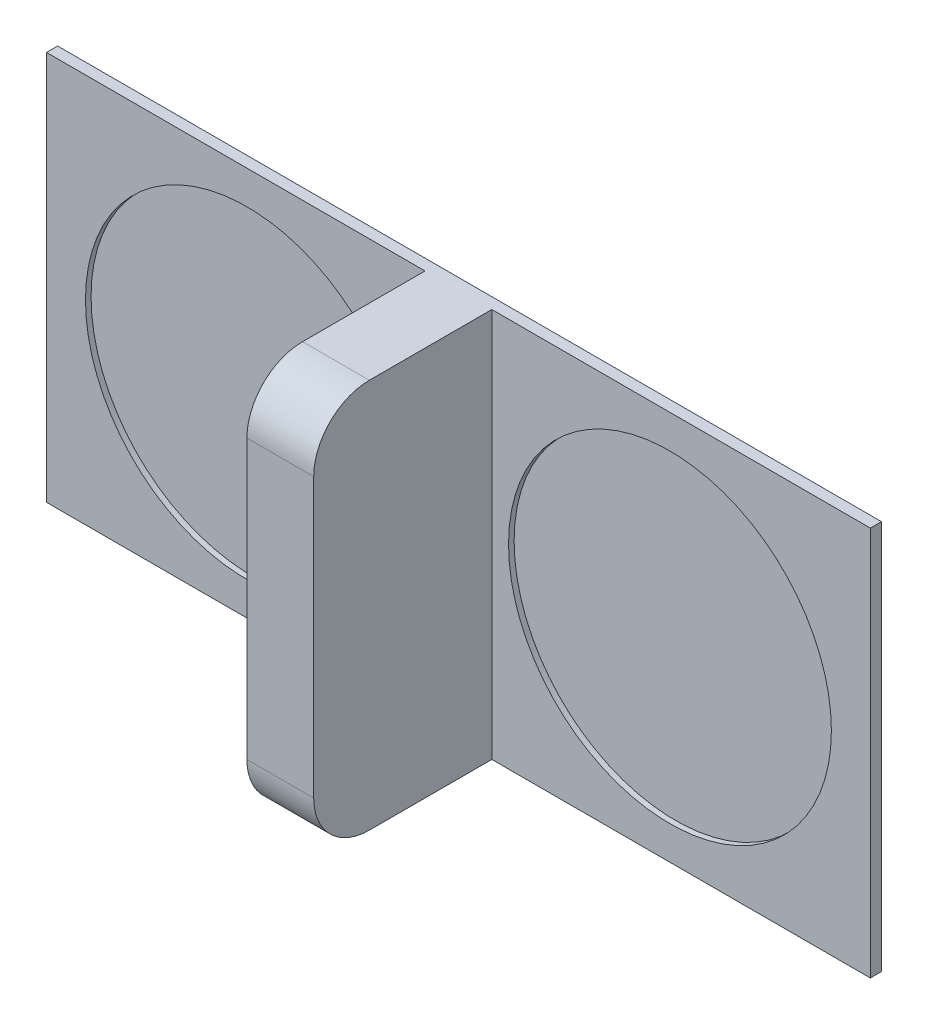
ISO-10303-21;
HEADER;
FILE_DESCRIPTION(('STEP AP214'),'2;1');
FILE_NAME('part.step','',(''),(''),'','','');
FILE_SCHEMA(('AUTOMOTIVE_DESIGN { 1 0 10303 214 1 1 1 1 }'));
ENDSEC;
DATA;
#1=APPLICATION_CONTEXT('core data for automotive mechanical design processes');
#2=APPLICATION_PROTOCOL_DEFINITION('international standard','automotive_design',2000,#1);
#3=PRODUCT_CONTEXT('',#1,'mechanical');
#4=PRODUCT('Part','Part','',(#3));
#5=PRODUCT_RELATED_PRODUCT_CATEGORY('part','',(#4));
#6=PRODUCT_DEFINITION_FORMATION('','',#4);
#7=PRODUCT_DEFINITION_CONTEXT('part definition',#1,'design');
#8=PRODUCT_DEFINITION('design','',#6,#7);
#9=PRODUCT_DEFINITION_SHAPE('','',#8);
#10=(LENGTH_UNIT() NAMED_UNIT(*) SI_UNIT(.MILLI.,.METRE.));
#11=(NAMED_UNIT(*) PLANE_ANGLE_UNIT() SI_UNIT($,.RADIAN.));
#12=(NAMED_UNIT(*) SI_UNIT($,.STERADIAN.) SOLID_ANGLE_UNIT());
#13=UNCERTAINTY_MEASURE_WITH_UNIT(LENGTH_MEASURE(1.E-05),#10,'distance_accuracy_value','');
#14=(GEOMETRIC_REPRESENTATION_CONTEXT(3) GLOBAL_UNCERTAINTY_ASSIGNED_CONTEXT((#13)) GLOBAL_UNIT_ASSIGNED_CONTEXT((#10,
#11,#12)) REPRESENTATION_CONTEXT('',''));
#15=CARTESIAN_POINT('',(0.,0.,0.));
#16=DIRECTION('',(0.,0.,1.));
#17=DIRECTION('',(1.,0.,0.));
#18=AXIS2_PLACEMENT_3D('',#15,#16,#17);
#19=CARTESIAN_POINT('',(-39.6404059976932,-6.92860438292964,0.254));
#20=DIRECTION('',(0.,0.,1.));
#21=DIRECTION('',(1.,0.,0.));
#22=AXIS2_PLACEMENT_3D('',#19,#20,#21);
#23=PLANE('',#22);
#24=DIRECTION('',(0.,1.,0.));
#25=VECTOR('',#24,1.);
#26=CARTESIAN_POINT('',(-29.4804059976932,-6.92860438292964,0.254));
#27=LINE('',#26,#25);
#28=CARTESIAN_POINT('',(-29.4804059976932,-6.92860438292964,0.254));
#29=VERTEX_POINT('',#28);
#30=CARTESIAN_POINT('',(-29.4804059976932,1.96139561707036,0.254));
#31=VERTEX_POINT('',#30);
#32=EDGE_CURVE('E133',#29,#31,#27,.T.);
#33=ORIENTED_EDGE('',*,*,#32,.F.);
#34=DIRECTION('',(1.,0.,0.));
#35=VECTOR('',#34,1.);
#36=CARTESIAN_POINT('',(-39.6404059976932,-6.92860438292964,0.254));
#37=LINE('',#36,#35);
#38=CARTESIAN_POINT('',(-20.8444059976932,-6.92860438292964,0.254));
#39=VERTEX_POINT('',#38);
#40=EDGE_CURVE('E128',#29,#39,#37,.T.);
#41=ORIENTED_EDGE('',*,*,#40,.T.);
#42=DIRECTION('',(0.,1.,0.));
#43=VECTOR('',#42,1.);
#44=CARTESIAN_POINT('',(-20.8444059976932,1.96139561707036,0.254));
#45=LINE('',#44,#43);
#46=CARTESIAN_POINT('',(-20.8444059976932,1.96139561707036,0.254));
#47=VERTEX_POINT('',#46);
#48=EDGE_CURVE('E127',#39,#47,#45,.T.);
#49=ORIENTED_EDGE('',*,*,#48,.T.);
#50=DIRECTION('',(-1.,0.,0.));
#51=VECTOR('',#50,1.);
#52=CARTESIAN_POINT('',(-39.6404059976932,1.96139561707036,0.254));
#53=LINE('',#52,#51);
#54=EDGE_CURVE('E193',#47,#31,#53,.T.);
#55=ORIENTED_EDGE('',*,*,#54,.T.);
#56=EDGE_LOOP('',(#33,#41,#49,#55));
#57=FACE_BOUND('',#56,.T.);
#58=CARTESIAN_POINT('',(-25.4164059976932,-2.48360438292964,0.254));
#59=DIRECTION('',(0.,0.,1.));
#60=DIRECTION('',(1.,0.,0.));
#61=AXIS2_PLACEMENT_3D('',#58,#59,#60);
#62=CIRCLE('',#61,3.683);
#63=CARTESIAN_POINT('',(-21.7334059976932,-2.48360438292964,0.254));
#64=VERTEX_POINT('',#63);
#65=EDGE_CURVE('E154',#64,#64,#62,.T.);
#66=ORIENTED_EDGE('',*,*,#65,.F.);
#67=EDGE_LOOP('',(#66));
#68=FACE_BOUND('',#67,.T.);
#69=ADVANCED_FACE('F29',(#57,#68),#23,.T.);
#70=CARTESIAN_POINT('',(-39.6404059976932,1.96139561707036,0.254));
#71=DIRECTION('',(1.,0.,0.));
#72=DIRECTION('',(0.,0.,-1.));
#73=AXIS2_PLACEMENT_3D('',#70,#71,#72);
#74=PLANE('',#73);
#75=DIRECTION('',(0.,-1.,0.));
#76=VECTOR('',#75,1.);
#77=CARTESIAN_POINT('',(-39.6404059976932,1.96139561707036,0.));
#78=LINE('',#77,#76);
#79=CARTESIAN_POINT('',(-39.6404059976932,1.96139561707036,0.));
#80=VERTEX_POINT('',#79);
#81=CARTESIAN_POINT('',(-39.6404059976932,-6.92860438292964,0.));
#82=VERTEX_POINT('',#81);
#83=EDGE_CURVE('E167',#80,#82,#78,.T.);
#84=ORIENTED_EDGE('',*,*,#83,.T.);
#85=DIRECTION('',(0.,0.,-1.));
#86=VECTOR('',#85,1.);
#87=CARTESIAN_POINT('',(-39.6404059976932,-6.92860438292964,0.254));
#88=LINE('',#87,#86);
#89=CARTESIAN_POINT('',(-39.6404059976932,-6.92860438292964,0.254));
#90=VERTEX_POINT('',#89);
#91=EDGE_CURVE('E182',#90,#82,#88,.T.);
#92=ORIENTED_EDGE('',*,*,#91,.F.);
#93=DIRECTION('',(0.,-1.,0.));
#94=VECTOR('',#93,1.);
#95=CARTESIAN_POINT('',(-39.6404059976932,1.96139561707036,0.254));
#96=LINE('',#95,#94);
#97=CARTESIAN_POINT('',(-39.6404059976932,1.96139561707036,0.254));
#98=VERTEX_POINT('',#97);
#99=EDGE_CURVE('E125',#98,#90,#96,.T.);
#100=ORIENTED_EDGE('',*,*,#99,.F.);
#101=DIRECTION('',(0.,0.,-1.));
#102=VECTOR('',#101,1.);
#103=CARTESIAN_POINT('',(-39.6404059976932,1.96139561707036,0.254));
#104=LINE('',#103,#102);
#105=EDGE_CURVE('E191',#98,#80,#104,.T.);
#106=ORIENTED_EDGE('',*,*,#105,.T.);
#107=EDGE_LOOP('',(#84,#92,#100,#106));
#108=FACE_BOUND('',#107,.T.);
#109=ADVANCED_FACE('F31',(#108),#74,.F.);
#110=CARTESIAN_POINT('',(-39.6404059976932,-6.92860438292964,0.254));
#111=DIRECTION('',(0.,1.,0.));
#112=DIRECTION('',(0.,0.,1.));
#113=AXIS2_PLACEMENT_3D('',#110,#111,#112);
#114=PLANE('',#113);
#115=DIRECTION('',(0.,0.,-1.));
#116=VECTOR('',#115,1.);
#117=CARTESIAN_POINT('',(-29.4804059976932,-6.92860438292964,4.318));
#118=LINE('',#117,#116);
#119=CARTESIAN_POINT('',(-29.4804059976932,-6.92860438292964,3.048));
#120=VERTEX_POINT('',#119);
#121=EDGE_CURVE('E116',#120,#29,#118,.T.);
#122=ORIENTED_EDGE('',*,*,#121,.F.);
#123=DIRECTION('',(1.,0.,0.));
#124=VECTOR('',#123,1.);
#125=CARTESIAN_POINT('',(-31.0044059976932,-6.92860438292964,3.048));
#126=LINE('',#125,#124);
#127=CARTESIAN_POINT('',(-31.0044059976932,-6.92860438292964,3.048));
#128=VERTEX_POINT('',#127);
#129=EDGE_CURVE('E11',#120,#128,#126,.F.);
#130=ORIENTED_EDGE('',*,*,#129,.T.);
#131=DIRECTION('',(0.,0.,-1.));
#132=VECTOR('',#131,1.);
#133=CARTESIAN_POINT('',(-31.0044059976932,-6.92860438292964,4.318));
#134=LINE('',#133,#132);
#135=CARTESIAN_POINT('',(-31.0044059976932,-6.92860438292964,0.254));
#136=VERTEX_POINT('',#135);
#137=EDGE_CURVE('E105',#128,#136,#134,.T.);
#138=ORIENTED_EDGE('',*,*,#137,.T.);
#139=EDGE_CURVE('E109',#90,#136,#37,.T.);
#140=ORIENTED_EDGE('',*,*,#139,.F.);
#141=ORIENTED_EDGE('',*,*,#91,.T.);
#142=DIRECTION('',(1.,0.,0.));
#143=VECTOR('',#142,1.);
#144=CARTESIAN_POINT('',(-39.6404059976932,-6.92860438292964,0.));
#145=LINE('',#144,#143);
#146=CARTESIAN_POINT('',(-20.8444059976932,-6.92860438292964,0.));
#147=VERTEX_POINT('',#146);
#148=EDGE_CURVE('E170',#82,#147,#145,.T.);
#149=ORIENTED_EDGE('',*,*,#148,.T.);
#150=DIRECTION('',(0.,0.,-1.));
#151=VECTOR('',#150,1.);
#152=CARTESIAN_POINT('',(-20.8444059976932,-6.92860438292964,0.254));
#153=LINE('',#152,#151);
#154=EDGE_CURVE('E185',#39,#147,#153,.T.);
#155=ORIENTED_EDGE('',*,*,#154,.F.);
#156=ORIENTED_EDGE('',*,*,#40,.F.);
#157=EDGE_LOOP('',(#122,#130,#138,#140,#141,#149,#155,#156));
#158=FACE_BOUND('',#157,.T.);
#159=ADVANCED_FACE('F107',(#158),#114,.F.);
#160=CARTESIAN_POINT('',(-20.8444059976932,1.96139561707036,0.254));
#161=DIRECTION('',(-1.,0.,0.));
#162=DIRECTION('',(0.,-1.,0.));
#163=AXIS2_PLACEMENT_3D('',#160,#161,#162);
#164=PLANE('',#163);
#165=DIRECTION('',(0.,1.,0.));
#166=VECTOR('',#165,1.);
#167=CARTESIAN_POINT('',(-20.8444059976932,1.96139561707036,0.));
#168=LINE('',#167,#166);
#169=CARTESIAN_POINT('',(-20.8444059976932,1.96139561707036,0.));
#170=VERTEX_POINT('',#169);
#171=EDGE_CURVE('E172',#147,#170,#168,.T.);
#172=ORIENTED_EDGE('',*,*,#171,.T.);
#173=DIRECTION('',(0.,0.,-1.));
#174=VECTOR('',#173,1.);
#175=CARTESIAN_POINT('',(-20.8444059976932,1.96139561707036,0.254));
#176=LINE('',#175,#174);
#177=EDGE_CURVE('E188',#47,#170,#176,.T.);
#178=ORIENTED_EDGE('',*,*,#177,.F.);
#179=ORIENTED_EDGE('',*,*,#48,.F.);
#180=ORIENTED_EDGE('',*,*,#154,.T.);
#181=EDGE_LOOP('',(#172,#178,#179,#180));
#182=FACE_BOUND('',#181,.T.);
#183=ADVANCED_FACE('F207',(#182),#164,.F.);
#184=CARTESIAN_POINT('',(-39.6404059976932,1.96139561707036,0.254));
#185=DIRECTION('',(0.,-1.,0.));
#186=DIRECTION('',(0.,0.,-1.));
#187=AXIS2_PLACEMENT_3D('',#184,#185,#186);
#188=PLANE('',#187);
#189=DIRECTION('',(0.,0.,-1.));
#190=VECTOR('',#189,1.);
#191=CARTESIAN_POINT('',(-31.0044059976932,1.96139561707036,4.318));
#192=LINE('',#191,#190);
#193=CARTESIAN_POINT('',(-31.0044059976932,1.96139561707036,3.048));
#194=VERTEX_POINT('',#193);
#195=CARTESIAN_POINT('',(-31.0044059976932,1.96139561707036,0.254));
#196=VERTEX_POINT('',#195);
#197=EDGE_CURVE('E115',#194,#196,#192,.T.);
#198=ORIENTED_EDGE('',*,*,#197,.F.);
#199=DIRECTION('',(-1.,0.,0.));
#200=VECTOR('',#199,1.);
#201=CARTESIAN_POINT('',(-29.4804059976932,1.96139561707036,3.048));
#202=LINE('',#201,#200);
#203=CARTESIAN_POINT('',(-29.4804059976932,1.96139561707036,3.048));
#204=VERTEX_POINT('',#203);
#205=EDGE_CURVE('E52',#194,#204,#202,.F.);
#206=ORIENTED_EDGE('',*,*,#205,.T.);
#207=DIRECTION('',(0.,0.,-1.));
#208=VECTOR('',#207,1.);
#209=CARTESIAN_POINT('',(-29.4804059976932,1.96139561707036,4.318));
#210=LINE('',#209,#208);
#211=EDGE_CURVE('E158',#204,#31,#210,.T.);
#212=ORIENTED_EDGE('',*,*,#211,.T.);
#213=ORIENTED_EDGE('',*,*,#54,.F.);
#214=ORIENTED_EDGE('',*,*,#177,.T.);
#215=DIRECTION('',(-1.,0.,0.));
#216=VECTOR('',#215,1.);
#217=CARTESIAN_POINT('',(-39.6404059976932,1.96139561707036,0.));
#218=LINE('',#217,#216);
#219=EDGE_CURVE('E174',#170,#80,#218,.T.);
#220=ORIENTED_EDGE('',*,*,#219,.T.);
#221=ORIENTED_EDGE('',*,*,#105,.F.);
#222=EDGE_CURVE('E143',#196,#98,#53,.T.);
#223=ORIENTED_EDGE('',*,*,#222,.F.);
#224=EDGE_LOOP('',(#198,#206,#212,#213,#214,#220,#221,#223));
#225=FACE_BOUND('',#224,.T.);
#226=ADVANCED_FACE('F210',(#225),#188,.F.);
#227=DIRECTION('',(0.,-1.,0.));
#228=VECTOR('',#227,1.);
#229=CARTESIAN_POINT('',(-31.0044059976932,-6.92860438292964,0.254));
#230=LINE('',#229,#228);
#231=EDGE_CURVE('E122',#196,#136,#230,.T.);
#232=ORIENTED_EDGE('',*,*,#231,.F.);
#233=ORIENTED_EDGE('',*,*,#222,.T.);
#234=ORIENTED_EDGE('',*,*,#99,.T.);
#235=ORIENTED_EDGE('',*,*,#139,.T.);
#236=EDGE_LOOP('',(#232,#233,#234,#235));
#237=FACE_BOUND('',#236,.T.);
#238=CARTESIAN_POINT('',(-35.0684059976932,-2.48360438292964,0.254));
#239=DIRECTION('',(0.,0.,1.));
#240=DIRECTION('',(1.,0.,0.));
#241=AXIS2_PLACEMENT_3D('',#238,#239,#240);
#242=CIRCLE('',#241,3.683);
#243=CARTESIAN_POINT('',(-31.3854059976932,-2.48360438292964,0.254));
#244=VERTEX_POINT('',#243);
#245=EDGE_CURVE('E161',#244,#244,#242,.T.);
#246=ORIENTED_EDGE('',*,*,#245,.F.);
#247=EDGE_LOOP('',(#246));
#248=FACE_BOUND('',#247,.T.);
#249=ADVANCED_FACE('F120',(#237,#248),#23,.T.);
#250=CARTESIAN_POINT('',(-39.6404059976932,-6.92860438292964,0.));
#251=DIRECTION('',(0.,0.,1.));
#252=DIRECTION('',(1.,0.,0.));
#253=AXIS2_PLACEMENT_3D('',#250,#251,#252);
#254=PLANE('',#253);
#255=ORIENTED_EDGE('',*,*,#83,.F.);
#256=ORIENTED_EDGE('',*,*,#219,.F.);
#257=ORIENTED_EDGE('',*,*,#171,.F.);
#258=ORIENTED_EDGE('',*,*,#148,.F.);
#259=EDGE_LOOP('',(#255,#256,#257,#258));
#260=FACE_BOUND('',#259,.T.);
#261=ADVANCED_FACE('F241',(#260),#254,.F.);
#262=CARTESIAN_POINT('',(-35.0684059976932,-2.48360438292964,0.127));
#263=DIRECTION('',(0.,0.,1.));
#264=DIRECTION('',(1.,0.,0.));
#265=AXIS2_PLACEMENT_3D('',#262,#263,#264);
#266=CYLINDRICAL_SURFACE('',#265,3.683);
#267=CARTESIAN_POINT('',(-35.0684059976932,-2.48360438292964,0.127));
#268=DIRECTION('',(0.,0.,1.));
#269=DIRECTION('',(1.,0.,0.));
#270=AXIS2_PLACEMENT_3D('',#267,#268,#269);
#271=CIRCLE('',#270,3.683);
#272=CARTESIAN_POINT('',(-31.3854059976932,-2.48360438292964,0.127));
#273=VERTEX_POINT('',#272);
#274=EDGE_CURVE('E164',#273,#273,#271,.T.);
#275=ORIENTED_EDGE('',*,*,#274,.F.);
#276=EDGE_LOOP('',(#275));
#277=FACE_BOUND('',#276,.T.);
#278=ORIENTED_EDGE('',*,*,#245,.T.);
#279=EDGE_LOOP('',(#278));
#280=FACE_BOUND('',#279,.T.);
#281=ADVANCED_FACE('F243',(#277,#280),#266,.F.);
#282=CARTESIAN_POINT('',(-35.0684059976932,-2.48360438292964,0.127));
#283=DIRECTION('',(0.,0.,1.));
#284=DIRECTION('',(1.,0.,0.));
#285=AXIS2_PLACEMENT_3D('',#282,#283,#284);
#286=PLANE('',#285);
#287=ORIENTED_EDGE('',*,*,#274,.T.);
#288=EDGE_LOOP('',(#287));
#289=FACE_BOUND('',#288,.T.);
#290=ADVANCED_FACE('F249',(#289),#286,.T.);
#291=CARTESIAN_POINT('',(-25.4164059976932,-2.48360438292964,0.127));
#292=DIRECTION('',(0.,0.,1.));
#293=DIRECTION('',(1.,0.,0.));
#294=AXIS2_PLACEMENT_3D('',#291,#292,#293);
#295=CYLINDRICAL_SURFACE('',#294,3.683);
#296=CARTESIAN_POINT('',(-25.4164059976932,-2.48360438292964,0.127));
#297=DIRECTION('',(0.,0.,1.));
#298=DIRECTION('',(1.,0.,0.));
#299=AXIS2_PLACEMENT_3D('',#296,#297,#298);
#300=CIRCLE('',#299,3.683);
#301=CARTESIAN_POINT('',(-21.7334059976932,-2.48360438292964,0.127));
#302=VERTEX_POINT('',#301);
#303=EDGE_CURVE('E157',#302,#302,#300,.T.);
#304=ORIENTED_EDGE('',*,*,#303,.F.);
#305=EDGE_LOOP('',(#304));
#306=FACE_BOUND('',#305,.T.);
#307=ORIENTED_EDGE('',*,*,#65,.T.);
#308=EDGE_LOOP('',(#307));
#309=FACE_BOUND('',#308,.T.);
#310=ADVANCED_FACE('F298',(#306,#309),#295,.F.);
#311=CARTESIAN_POINT('',(-25.4164059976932,-2.48360438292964,0.127));
#312=DIRECTION('',(0.,0.,1.));
#313=DIRECTION('',(1.,0.,0.));
#314=AXIS2_PLACEMENT_3D('',#311,#312,#313);
#315=PLANE('',#314);
#316=ORIENTED_EDGE('',*,*,#303,.T.);
#317=EDGE_LOOP('',(#316));
#318=FACE_BOUND('',#317,.T.);
#319=ADVANCED_FACE('F308',(#318),#315,.T.);
#320=CARTESIAN_POINT('',(-29.4804059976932,-6.92860438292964,4.318));
#321=DIRECTION('',(-1.,0.,0.));
#322=DIRECTION('',(0.,-1.,0.));
#323=AXIS2_PLACEMENT_3D('',#320,#321,#322);
#324=PLANE('',#323);
#325=ORIENTED_EDGE('',*,*,#211,.F.);
#326=CARTESIAN_POINT('',(-29.4804059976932,0.691395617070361,3.048));
#327=DIRECTION('',(-1.,0.,0.));
#328=DIRECTION('',(0.,-1.,0.));
#329=AXIS2_PLACEMENT_3D('',#326,#327,#328);
#330=CIRCLE('',#329,1.27);
#331=CARTESIAN_POINT('',(-29.4804059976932,0.691395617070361,4.318));
#332=VERTEX_POINT('',#331);
#333=EDGE_CURVE('E37',#204,#332,#330,.F.);
#334=ORIENTED_EDGE('',*,*,#333,.T.);
#335=DIRECTION('',(0.,1.,0.));
#336=VECTOR('',#335,1.);
#337=CARTESIAN_POINT('',(-29.4804059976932,-6.92860438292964,4.318));
#338=LINE('',#337,#336);
#339=CARTESIAN_POINT('',(-29.4804059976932,-5.65860438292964,4.318));
#340=VERTEX_POINT('',#339);
#341=EDGE_CURVE('E132',#340,#332,#338,.T.);
#342=ORIENTED_EDGE('',*,*,#341,.F.);
#343=CARTESIAN_POINT('',(-29.4804059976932,-5.65860438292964,3.048));
#344=DIRECTION('',(-1.,0.,0.));
#345=DIRECTION('',(0.,-1.,0.));
#346=AXIS2_PLACEMENT_3D('',#343,#344,#345);
#347=CIRCLE('',#346,1.27);
#348=EDGE_CURVE('E44',#340,#120,#347,.F.);
#349=ORIENTED_EDGE('',*,*,#348,.T.);
#350=ORIENTED_EDGE('',*,*,#121,.T.);
#351=ORIENTED_EDGE('',*,*,#32,.T.);
#352=EDGE_LOOP('',(#325,#334,#342,#349,#350,#351));
#353=FACE_BOUND('',#352,.T.);
#354=ADVANCED_FACE('F227',(#353),#324,.F.);
#355=CARTESIAN_POINT('',(-31.0044059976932,-6.92860438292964,4.318));
#356=DIRECTION('',(1.,0.,0.));
#357=DIRECTION('',(0.,0.,-1.));
#358=AXIS2_PLACEMENT_3D('',#355,#356,#357);
#359=PLANE('',#358);
#360=DIRECTION('',(0.,-1.,0.));
#361=VECTOR('',#360,1.);
#362=CARTESIAN_POINT('',(-31.0044059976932,-6.92860438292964,4.318));
#363=LINE('',#362,#361);
#364=CARTESIAN_POINT('',(-31.0044059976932,0.691395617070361,4.318));
#365=VERTEX_POINT('',#364);
#366=CARTESIAN_POINT('',(-31.0044059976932,-5.65860438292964,4.318));
#367=VERTEX_POINT('',#366);
#368=EDGE_CURVE('E136',#365,#367,#363,.T.);
#369=ORIENTED_EDGE('',*,*,#368,.F.);
#370=CARTESIAN_POINT('',(-31.0044059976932,0.691395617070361,3.048));
#371=DIRECTION('',(1.,0.,0.));
#372=DIRECTION('',(0.,0.,-1.));
#373=AXIS2_PLACEMENT_3D('',#370,#371,#372);
#374=CIRCLE('',#373,1.27);
#375=EDGE_CURVE('E217',#365,#194,#374,.F.);
#376=ORIENTED_EDGE('',*,*,#375,.T.);
#377=ORIENTED_EDGE('',*,*,#197,.T.);
#378=ORIENTED_EDGE('',*,*,#231,.T.);
#379=ORIENTED_EDGE('',*,*,#137,.F.);
#380=CARTESIAN_POINT('',(-31.0044059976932,-5.65860438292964,3.048));
#381=DIRECTION('',(1.,0.,0.));
#382=DIRECTION('',(0.,0.,-1.));
#383=AXIS2_PLACEMENT_3D('',#380,#381,#382);
#384=CIRCLE('',#383,1.27);
#385=EDGE_CURVE('E237',#128,#367,#384,.F.);
#386=ORIENTED_EDGE('',*,*,#385,.T.);
#387=EDGE_LOOP('',(#369,#376,#377,#378,#379,#386));
#388=FACE_BOUND('',#387,.T.);
#389=ADVANCED_FACE('F131',(#388),#359,.F.);
#390=CARTESIAN_POINT('',(-29.4804059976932,-6.92860438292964,4.318));
#391=DIRECTION('',(0.,0.,1.));
#392=DIRECTION('',(1.,0.,0.));
#393=AXIS2_PLACEMENT_3D('',#390,#391,#392);
#394=PLANE('',#393);
#395=ORIENTED_EDGE('',*,*,#341,.T.);
#396=DIRECTION('',(-1.,0.,0.));
#397=VECTOR('',#396,1.);
#398=CARTESIAN_POINT('',(-31.0044059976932,0.691395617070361,4.318));
#399=LINE('',#398,#397);
#400=EDGE_CURVE('E234',#332,#365,#399,.T.);
#401=ORIENTED_EDGE('',*,*,#400,.T.);
#402=ORIENTED_EDGE('',*,*,#368,.T.);
#403=DIRECTION('',(1.,0.,0.));
#404=VECTOR('',#403,1.);
#405=CARTESIAN_POINT('',(-29.4804059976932,-5.65860438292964,4.318));
#406=LINE('',#405,#404);
#407=EDGE_CURVE('E184',#367,#340,#406,.T.);
#408=ORIENTED_EDGE('',*,*,#407,.T.);
#409=EDGE_LOOP('',(#395,#401,#402,#408));
#410=FACE_BOUND('',#409,.T.);
#411=ADVANCED_FACE('F233',(#410),#394,.T.);
#412=CARTESIAN_POINT('',(-29.4804059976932,0.691395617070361,3.048));
#413=DIRECTION('',(1.,0.,0.));
#414=DIRECTION('',(0.,0.,-1.));
#415=AXIS2_PLACEMENT_3D('',#412,#413,#414);
#416=CYLINDRICAL_SURFACE('',#415,1.27);
#417=ORIENTED_EDGE('',*,*,#333,.F.);
#418=ORIENTED_EDGE('',*,*,#205,.F.);
#419=ORIENTED_EDGE('',*,*,#375,.F.);
#420=ORIENTED_EDGE('',*,*,#400,.F.);
#421=EDGE_LOOP('',(#417,#418,#419,#420));
#422=FACE_BOUND('',#421,.T.);
#423=ADVANCED_FACE('F236',(#422),#416,.T.);
#424=CARTESIAN_POINT('',(-29.4804059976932,-5.65860438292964,3.048));
#425=DIRECTION('',(-1.,0.,0.));
#426=DIRECTION('',(0.,0.,1.));
#427=AXIS2_PLACEMENT_3D('',#424,#425,#426);
#428=CYLINDRICAL_SURFACE('',#427,1.27);
#429=ORIENTED_EDGE('',*,*,#385,.F.);
#430=ORIENTED_EDGE('',*,*,#129,.F.);
#431=ORIENTED_EDGE('',*,*,#348,.F.);
#432=ORIENTED_EDGE('',*,*,#407,.F.);
#433=EDGE_LOOP('',(#429,#430,#431,#432));
#434=FACE_BOUND('',#433,.T.);
#435=ADVANCED_FACE('F352',(#434),#428,.T.);
#436=CLOSED_SHELL('',(#69,#109,#159,#183,#226,#249,#261,#281,#290,#310,#319,#354,#389,#411,#423,#435));
#437=MANIFOLD_SOLID_BREP('B2',#436);
#438=ADVANCED_BREP_SHAPE_REPRESENTATION('',(#18,#437),#14);
#439=SHAPE_DEFINITION_REPRESENTATION(#9,#438);
ENDSEC;
END-ISO-10303-21;
